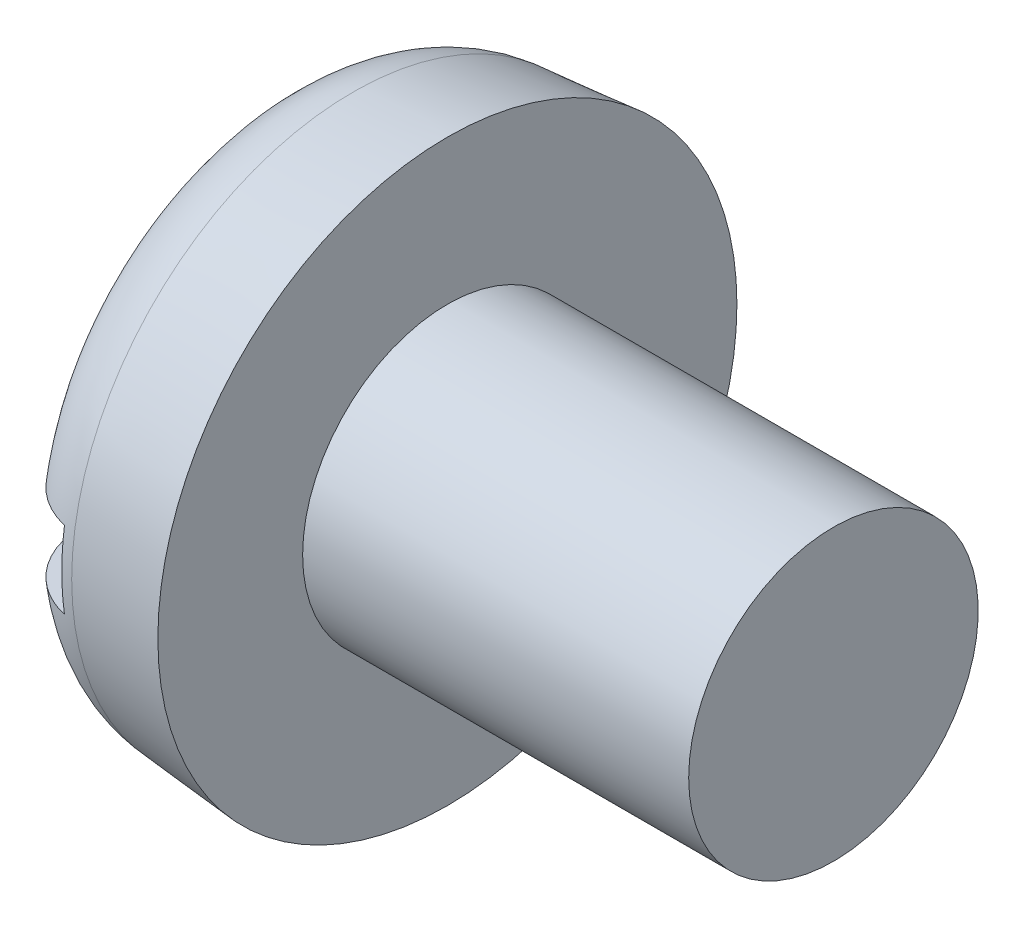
from build123d import *

# Parameters (mm, degrees)
FILLET2_R  = 1.8
SKETCH2_W  = 12
SKETCH2_H  = 1.6
SLOT_DEPTH = 1.4


with BuildPart() as part:
    # BodySke → Base-Revolve (revolve)
    with BuildSketch(Plane.XY, mode=Mode.PRIVATE) as base_revolve_sk:
        Polygon((3.6, 3), (3.6, 6), (0, 5.685040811), (0, 0), (11.6, 0), (11.6, 3), align=None)
    revolve(base_revolve_sk.sketch.rotate(Axis((-25.4, 0, 0), (1, 0, 0)), 90), axis=Axis((-25.4, 0, 0), (1, 0, 0)))

    # Fillet2
    fillet2_edges = [part.edges().sort_by_distance(p)[0] for p in [
        (0, 0, -5.685040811),
    ]]
    fillet(fillet2_edges, radius=FILLET2_R)

    # Sketch2 → Slot (cut)
    with BuildSketch(Plane(origin=(0, 0, 0), x_dir=(0, 0, -1), z_dir=(1, 0, 0))):
        Rectangle(SKETCH2_W, SKETCH2_H)
    extrude(amount=SLOT_DEPTH, mode=Mode.SUBTRACT)


solid = part.part
